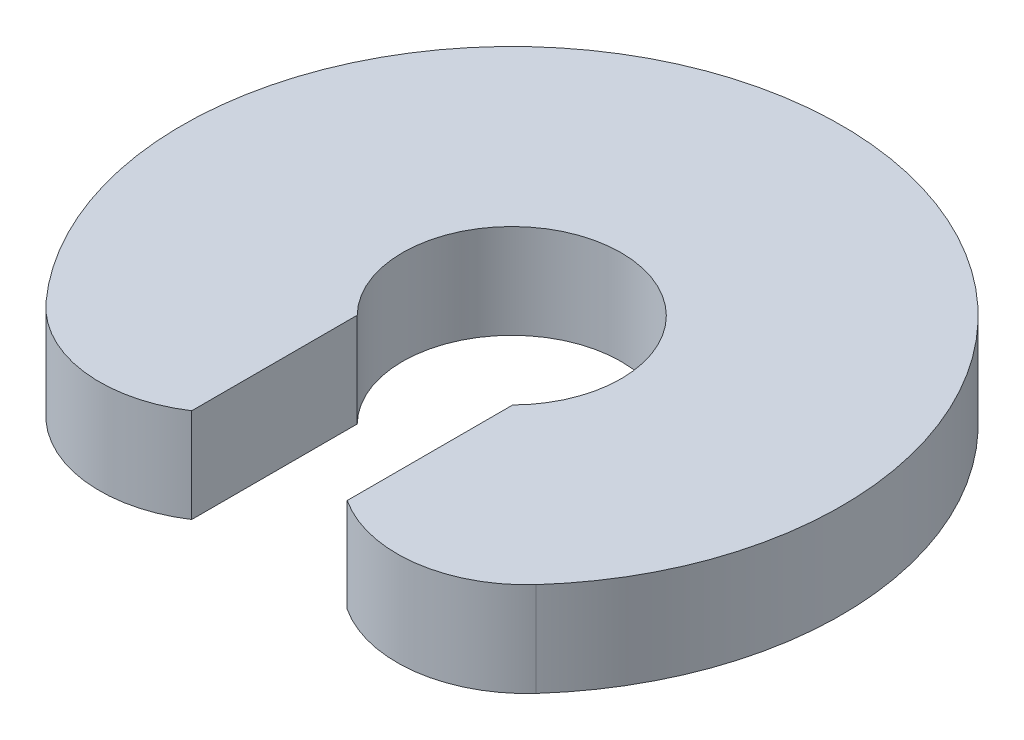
from build123d import *

# Parameters (mm, degrees)
EXTRUDE_1_DEPTH     = 200
SKETCH_4_W          = 330
SKETCH_4_H          = 236.766787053
CUT_EXTRUDE_3_DEPTH = 1010.950493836


with BuildPart() as part:
    # Sketch 1 → Extrude 1 (new body)
    with BuildSketch(Plane(origin=(0, 0, 0), x_dir=(1, 0, 0), z_dir=(0, 1, 0))):
        with BuildLine():
            Line((165, -163.06919349), (165, -277.555745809))
            ThreePointArc((165, -277.555745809), (106.218215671, -304.926028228), (43.15312308, -320))
            ThreePointArc((43.15312308, -320), (82.850274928, -430.470874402), (165, -514.322532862))
            ThreePointArc((165, -514.322532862), (351.103188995, -557.109795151), (520.201377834, -468.391424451))
            ThreePointArc((520.201377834, -468.391424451), (0, 700), (-520.201377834, -468.391424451))
            ThreePointArc((-520.201377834, -468.391424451), (-351.103188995, -557.109795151), (-165, -514.322532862))
            ThreePointArc((-165, -514.322532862), (-82.850274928, -430.470874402), (-43.15312308, -320))
            ThreePointArc((-43.15312308, -320), (-106.218215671, -304.926028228), (-165, -277.555745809))
            Line((-165, -277.555745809), (-165, -163.06919349))
            ThreePointArc((-165, -163.06919349), (0, 231.983968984), (165, -163.06919349))
        make_face()
    extrude(amount=EXTRUDE_1_DEPTH)

    # Sketch 4 → Cut-Extrude 3 (cut, through all)
    with BuildSketch(Plane.XZ):
        with Locations((0, 395.939139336)):
            Rectangle(SKETCH_4_W, SKETCH_4_H)
    extrude(amount=-CUT_EXTRUDE_3_DEPTH, mode=Mode.SUBTRACT)


solid = part.part
